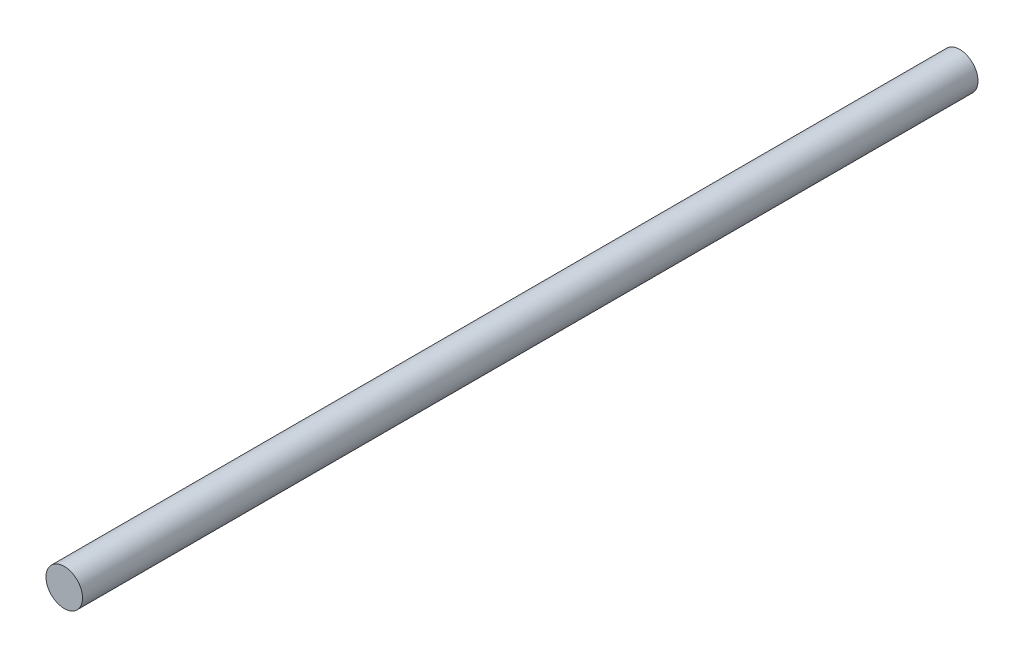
ISO-10303-21;
HEADER;
FILE_DESCRIPTION(('STEP AP214'),'2;1');
FILE_NAME('part.step','',(''),(''),'','','');
FILE_SCHEMA(('AUTOMOTIVE_DESIGN { 1 0 10303 214 1 1 1 1 }'));
ENDSEC;
DATA;
#1=APPLICATION_CONTEXT('core data for automotive mechanical design processes');
#2=APPLICATION_PROTOCOL_DEFINITION('international standard','automotive_design',2000,#1);
#3=PRODUCT_CONTEXT('',#1,'mechanical');
#4=PRODUCT('Part','Part','',(#3));
#5=PRODUCT_RELATED_PRODUCT_CATEGORY('part','',(#4));
#6=PRODUCT_DEFINITION_FORMATION('','',#4);
#7=PRODUCT_DEFINITION_CONTEXT('part definition',#1,'design');
#8=PRODUCT_DEFINITION('design','',#6,#7);
#9=PRODUCT_DEFINITION_SHAPE('','',#8);
#10=(LENGTH_UNIT() NAMED_UNIT(*) SI_UNIT(.MILLI.,.METRE.));
#11=(NAMED_UNIT(*) PLANE_ANGLE_UNIT() SI_UNIT($,.RADIAN.));
#12=(NAMED_UNIT(*) SI_UNIT($,.STERADIAN.) SOLID_ANGLE_UNIT());
#13=UNCERTAINTY_MEASURE_WITH_UNIT(LENGTH_MEASURE(1.E-05),#10,'distance_accuracy_value','');
#14=(GEOMETRIC_REPRESENTATION_CONTEXT(3) GLOBAL_UNCERTAINTY_ASSIGNED_CONTEXT((#13)) GLOBAL_UNIT_ASSIGNED_CONTEXT((#10,
#11,#12)) REPRESENTATION_CONTEXT('',''));
#15=CARTESIAN_POINT('',(0.,0.,0.));
#16=DIRECTION('',(0.,0.,1.));
#17=DIRECTION('',(1.,0.,0.));
#18=AXIS2_PLACEMENT_3D('',#15,#16,#17);
#19=CARTESIAN_POINT('',(0.,0.,490.));
#20=DIRECTION('',(0.,0.,-1.));
#21=DIRECTION('',(-1.,0.,0.));
#22=AXIS2_PLACEMENT_3D('',#19,#20,#21);
#23=CYLINDRICAL_SURFACE('',#22,10.);
#24=CARTESIAN_POINT('',(0.,0.,490.));
#25=DIRECTION('',(0.,0.,1.));
#26=DIRECTION('',(1.,0.,0.));
#27=AXIS2_PLACEMENT_3D('',#24,#25,#26);
#28=CIRCLE('',#27,10.);
#29=CARTESIAN_POINT('',(10.,0.,490.));
#30=VERTEX_POINT('',#29);
#31=EDGE_CURVE('E8',#30,#30,#28,.T.);
#32=ORIENTED_EDGE('',*,*,#31,.F.);
#33=EDGE_LOOP('',(#32));
#34=FACE_BOUND('',#33,.T.);
#35=CARTESIAN_POINT('',(0.,0.,0.));
#36=DIRECTION('',(0.,0.,1.));
#37=DIRECTION('',(1.,0.,0.));
#38=AXIS2_PLACEMENT_3D('',#35,#36,#37);
#39=CIRCLE('',#38,10.);
#40=CARTESIAN_POINT('',(10.,0.,0.));
#41=VERTEX_POINT('',#40);
#42=EDGE_CURVE('E18',#41,#41,#39,.T.);
#43=ORIENTED_EDGE('',*,*,#42,.T.);
#44=EDGE_LOOP('',(#43));
#45=FACE_BOUND('',#44,.T.);
#46=ADVANCED_FACE('F12',(#34,#45),#23,.T.);
#47=CARTESIAN_POINT('',(0.,0.,490.));
#48=DIRECTION('',(0.,0.,1.));
#49=DIRECTION('',(1.,0.,0.));
#50=AXIS2_PLACEMENT_3D('',#47,#48,#49);
#51=PLANE('',#50);
#52=ORIENTED_EDGE('',*,*,#31,.T.);
#53=EDGE_LOOP('',(#52));
#54=FACE_BOUND('',#53,.T.);
#55=ADVANCED_FACE('F27',(#54),#51,.T.);
#56=CARTESIAN_POINT('',(0.,0.,0.));
#57=DIRECTION('',(0.,0.,1.));
#58=DIRECTION('',(1.,0.,0.));
#59=AXIS2_PLACEMENT_3D('',#56,#57,#58);
#60=PLANE('',#59);
#61=ORIENTED_EDGE('',*,*,#42,.F.);
#62=EDGE_LOOP('',(#61));
#63=FACE_BOUND('',#62,.T.);
#64=ADVANCED_FACE('F25',(#63),#60,.F.);
#65=CLOSED_SHELL('',(#46,#55,#64));
#66=MANIFOLD_SOLID_BREP('B1',#65);
#67=ADVANCED_BREP_SHAPE_REPRESENTATION('',(#18,#66),#14);
#68=SHAPE_DEFINITION_REPRESENTATION(#9,#67);
ENDSEC;
END-ISO-10303-21;
